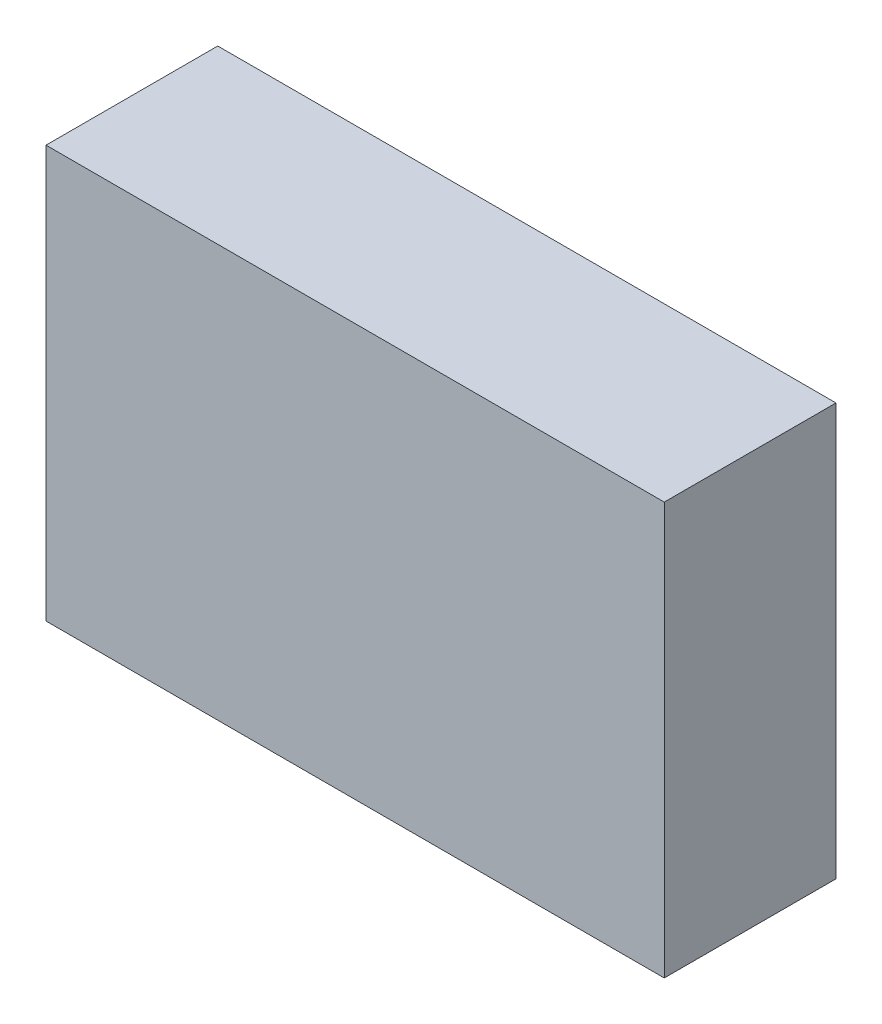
from build123d import *

# Parameters (mm, degrees)
ESQUISSE2_W          = 90
ESQUISSE2_H          = 60
BASE_EXTRUSION_DEPTH = 25


with BuildPart() as part:
    # Esquisse2 → Base-Extrusion (new body)
    with BuildSketch(Plane.XY):
        with Locations((-378.056632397, 547.373354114)):
            Rectangle(ESQUISSE2_W, ESQUISSE2_H)
    extrude(amount=BASE_EXTRUSION_DEPTH)


solid = part.part
